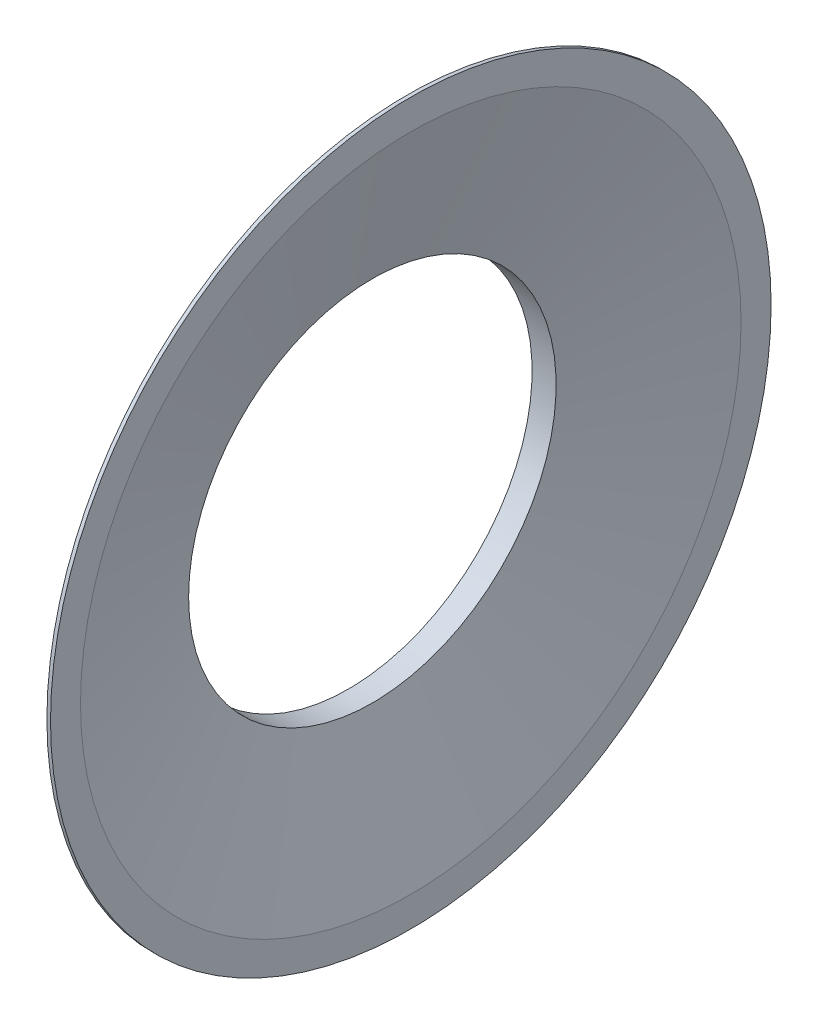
from build123d import *


with BuildPart() as part:
    # Sketch 1 → Revolve 1 (revolve)
    with BuildSketch(Plane.XY, mode=Mode.PRIVATE) as revolve_1_sk:
        Polygon((0, 30.6), (0, 31.2), (3.4, 31.2), (9.8, 55), (9.8, 60), (10.4, 60), (10.4, 55), (4, 30.6), align=None)
    revolve(revolve_1_sk.sketch.rotate(Axis((0, 0, 0), (1, 0, 0)), 90), axis=Axis((0, 0, 0), (1, 0, 0)))


solid = part.part
